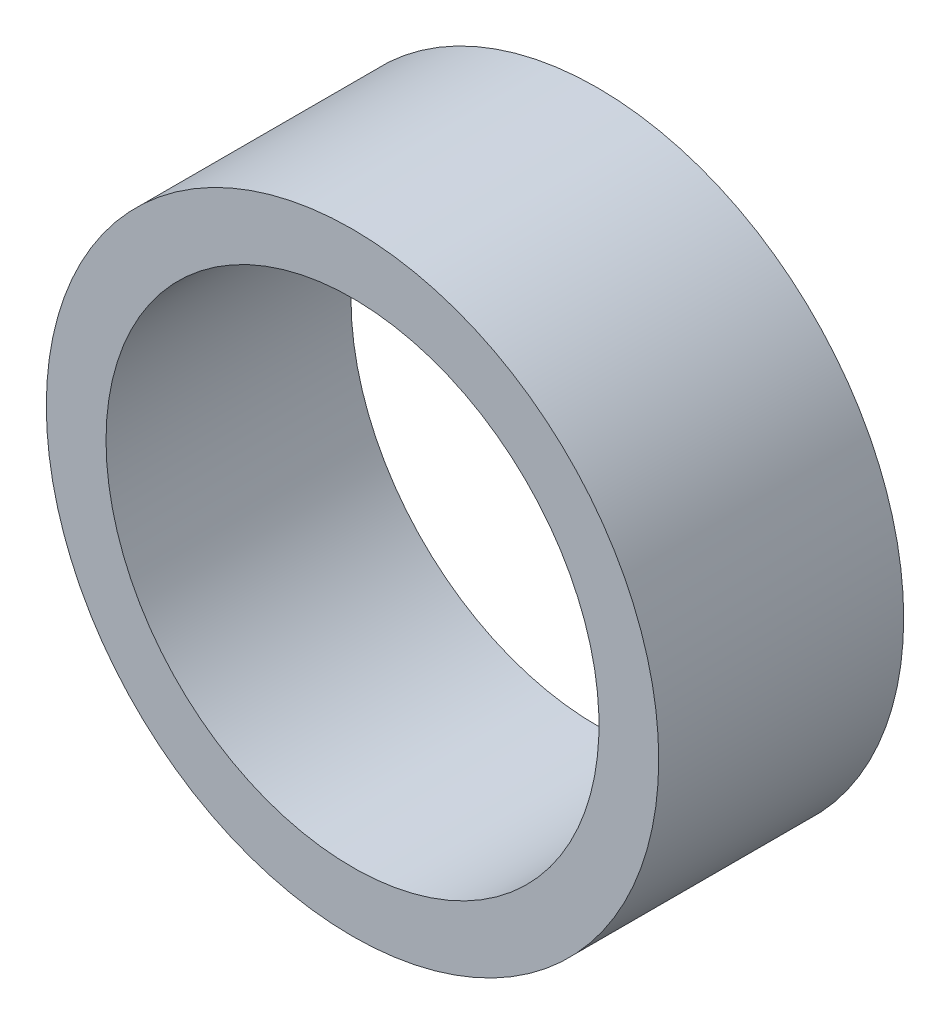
ISO-10303-21;
HEADER;
FILE_DESCRIPTION(('STEP AP214'),'2;1');
FILE_NAME('part.step','',(''),(''),'','','');
FILE_SCHEMA(('AUTOMOTIVE_DESIGN { 1 0 10303 214 1 1 1 1 }'));
ENDSEC;
DATA;
#1=APPLICATION_CONTEXT('core data for automotive mechanical design processes');
#2=APPLICATION_PROTOCOL_DEFINITION('international standard','automotive_design',2000,#1);
#3=PRODUCT_CONTEXT('',#1,'mechanical');
#4=PRODUCT('Part','Part','',(#3));
#5=PRODUCT_RELATED_PRODUCT_CATEGORY('part','',(#4));
#6=PRODUCT_DEFINITION_FORMATION('','',#4);
#7=PRODUCT_DEFINITION_CONTEXT('part definition',#1,'design');
#8=PRODUCT_DEFINITION('design','',#6,#7);
#9=PRODUCT_DEFINITION_SHAPE('','',#8);
#10=(LENGTH_UNIT() NAMED_UNIT(*) SI_UNIT(.MILLI.,.METRE.));
#11=(NAMED_UNIT(*) PLANE_ANGLE_UNIT() SI_UNIT($,.RADIAN.));
#12=(NAMED_UNIT(*) SI_UNIT($,.STERADIAN.) SOLID_ANGLE_UNIT());
#13=UNCERTAINTY_MEASURE_WITH_UNIT(LENGTH_MEASURE(1.E-05),#10,'distance_accuracy_value','');
#14=(GEOMETRIC_REPRESENTATION_CONTEXT(3) GLOBAL_UNCERTAINTY_ASSIGNED_CONTEXT((#13)) GLOBAL_UNIT_ASSIGNED_CONTEXT((#10,
#11,#12)) REPRESENTATION_CONTEXT('',''));
#15=CARTESIAN_POINT('',(0.,0.,0.));
#16=DIRECTION('',(0.,0.,1.));
#17=DIRECTION('',(1.,0.,0.));
#18=AXIS2_PLACEMENT_3D('',#15,#16,#17);
#19=CARTESIAN_POINT('',(0.,0.,-38.9763628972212));
#20=DIRECTION('',(0.,0.,-1.));
#21=DIRECTION('',(-1.,0.,0.));
#22=AXIS2_PLACEMENT_3D('',#19,#20,#21);
#23=CYLINDRICAL_SURFACE('',#22,6.3895);
#24=CARTESIAN_POINT('',(0.,0.,6.34999999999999));
#25=DIRECTION('',(0.,0.,-1.));
#26=DIRECTION('',(-1.,0.,0.));
#27=AXIS2_PLACEMENT_3D('',#24,#25,#26);
#28=CIRCLE('',#27,6.3895);
#29=CARTESIAN_POINT('',(-6.3895,0.,6.34999999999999));
#30=VERTEX_POINT('',#29);
#31=EDGE_CURVE('E10',#30,#30,#28,.T.);
#32=ORIENTED_EDGE('',*,*,#31,.F.);
#33=EDGE_LOOP('',(#32));
#34=FACE_BOUND('',#33,.T.);
#35=CARTESIAN_POINT('',(0.,0.,0.));
#36=DIRECTION('',(0.,0.,-1.));
#37=DIRECTION('',(-1.,0.,0.));
#38=AXIS2_PLACEMENT_3D('',#35,#36,#37);
#39=CIRCLE('',#38,6.3895);
#40=CARTESIAN_POINT('',(-6.3895,0.,0.));
#41=VERTEX_POINT('',#40);
#42=EDGE_CURVE('E58',#41,#41,#39,.T.);
#43=ORIENTED_EDGE('',*,*,#42,.T.);
#44=EDGE_LOOP('',(#43));
#45=FACE_BOUND('',#44,.T.);
#46=ADVANCED_FACE('F39',(#34,#45),#23,.F.);
#47=CARTESIAN_POINT('',(-6.38950000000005,0.,6.34999999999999));
#48=DIRECTION('',(0.,0.,-1.));
#49=DIRECTION('',(-1.,0.,0.));
#50=AXIS2_PLACEMENT_3D('',#47,#48,#49);
#51=PLANE('',#50);
#52=CARTESIAN_POINT('',(0.,0.,6.34999999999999));
#53=DIRECTION('',(0.,0.,-1.));
#54=DIRECTION('',(-1.,0.,0.));
#55=AXIS2_PLACEMENT_3D('',#52,#53,#54);
#56=CIRCLE('',#55,7.9375);
#57=CARTESIAN_POINT('',(-7.9375,0.,6.34999999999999));
#58=VERTEX_POINT('',#57);
#59=EDGE_CURVE('E46',#58,#58,#56,.T.);
#60=ORIENTED_EDGE('',*,*,#59,.F.);
#61=EDGE_LOOP('',(#60));
#62=FACE_BOUND('',#61,.T.);
#63=ORIENTED_EDGE('',*,*,#31,.T.);
#64=EDGE_LOOP('',(#63));
#65=FACE_BOUND('',#64,.T.);
#66=ADVANCED_FACE('F75',(#62,#65),#51,.F.);
#67=CARTESIAN_POINT('',(0.,0.,-38.9763628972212));
#68=DIRECTION('',(0.,0.,-1.));
#69=DIRECTION('',(-1.,0.,0.));
#70=AXIS2_PLACEMENT_3D('',#67,#68,#69);
#71=CYLINDRICAL_SURFACE('',#70,7.9375);
#72=CARTESIAN_POINT('',(0.,0.,0.));
#73=DIRECTION('',(0.,0.,-1.));
#74=DIRECTION('',(-1.,0.,0.));
#75=AXIS2_PLACEMENT_3D('',#72,#73,#74);
#76=CIRCLE('',#75,7.9375);
#77=CARTESIAN_POINT('',(-7.9375,0.,0.));
#78=VERTEX_POINT('',#77);
#79=EDGE_CURVE('E52',#78,#78,#76,.T.);
#80=ORIENTED_EDGE('',*,*,#79,.F.);
#81=EDGE_LOOP('',(#80));
#82=FACE_BOUND('',#81,.T.);
#83=ORIENTED_EDGE('',*,*,#59,.T.);
#84=EDGE_LOOP('',(#83));
#85=FACE_BOUND('',#84,.T.);
#86=ADVANCED_FACE('F70',(#82,#85),#71,.T.);
#87=CARTESIAN_POINT('',(-7.93750000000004,0.,0.));
#88=DIRECTION('',(0.,0.,1.));
#89=DIRECTION('',(1.,0.,0.));
#90=AXIS2_PLACEMENT_3D('',#87,#88,#89);
#91=PLANE('',#90);
#92=ORIENTED_EDGE('',*,*,#42,.F.);
#93=EDGE_LOOP('',(#92));
#94=FACE_BOUND('',#93,.T.);
#95=ORIENTED_EDGE('',*,*,#79,.T.);
#96=EDGE_LOOP('',(#95));
#97=FACE_BOUND('',#96,.T.);
#98=ADVANCED_FACE('F67',(#94,#97),#91,.F.);
#99=CLOSED_SHELL('',(#46,#66,#86,#98));
#100=MANIFOLD_SOLID_BREP('B2',#99);
#101=ADVANCED_BREP_SHAPE_REPRESENTATION('',(#18,#100),#14);
#102=SHAPE_DEFINITION_REPRESENTATION(#9,#101);
ENDSEC;
END-ISO-10303-21;
